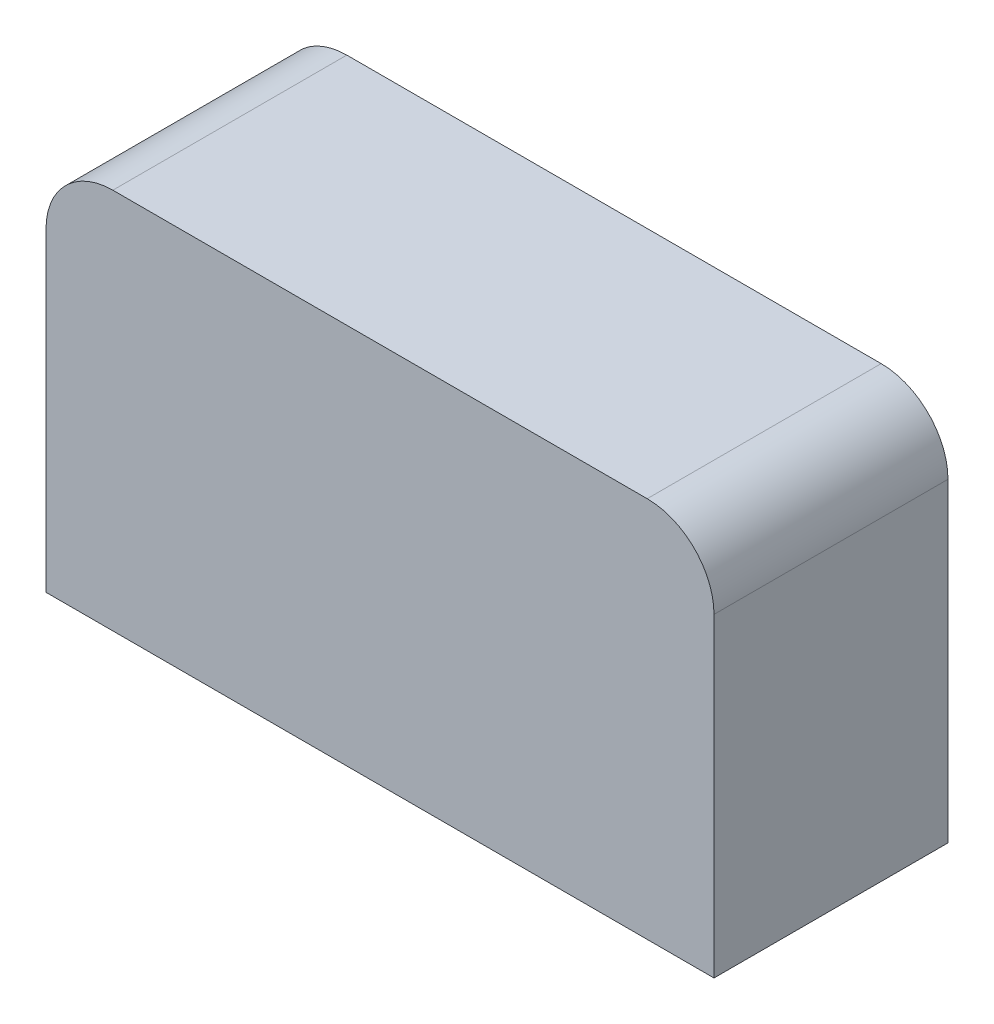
from build123d import *

# Parameters (mm, degrees)
SKETCH1_W           = 70
SKETCH1_H           = 40
BOSS_EXTRUDE1_DEPTH = 24.52
FILLET1_R           = 7
FILLET2_R           = 7
SKETCH4_W           = 36
SKETCH4_H           = 36
CUT_EXTRUDE1_DEPTH  = 20.45
SKETCH7_R           = 3.15
CUT_EXTRUDE2_DEPTH  = 8
CUT_EXTRUDE6_DEPTH  = 3
SKETCH16_R          = 3
CUT_EXTRUDE7_DEPTH  = 1


with BuildPart() as part:
    # Sketch1 → Boss-Extrude1 (new body)
    with BuildSketch(Plane.XY):
        with Locations((35, 20)):
            Rectangle(SKETCH1_W, SKETCH1_H)
    extrude(amount=BOSS_EXTRUDE1_DEPTH)

    # Fillet1
    fillet1_edges = [part.edges().sort_by_distance(p)[0] for p in [
        (0, 40, 12.26),
    ]]
    fillet(fillet1_edges, radius=FILLET1_R)

    # Fillet2
    fillet2_edges = [part.edges().sort_by_distance(p)[0] for p in [
        (70, 40, 12.26),
    ]]
    fillet(fillet2_edges, radius=FILLET2_R)

    # Sketch4 → Cut-Extrude1 (cut)
    with BuildSketch(Plane(origin=(0, 0, 0), x_dir=(-1, 0, 0), z_dir=(0, 0, -1))):
        with Locations((-35, 18)):
            Rectangle(SKETCH4_W, SKETCH4_H)
    extrude(amount=-CUT_EXTRUDE1_DEPTH, mode=Mode.SUBTRACT)

    # Sketch7 → Cut-Extrude2 (cut)
    with BuildSketch(Plane(origin=(0, 0, 0), x_dir=(-1, 0, 0), z_dir=(0, 0, -1))):
        with Locations((-65.185, 18)):
            Circle(SKETCH7_R)
        with Locations((-4.815, 18)):
            Circle(SKETCH7_R)
    extrude(amount=-CUT_EXTRUDE2_DEPTH, mode=Mode.SUBTRACT)

    # Sketch15 → Cut-Extrude6 (cut)
    with BuildSketch(Plane(origin=(0, 0, 0), x_dir=(-1, 0, 0), z_dir=(0, 0, -1))):
        with BuildLine():
            Line((-60.650183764, 18.749837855), (-53, 25.5))
            Line((-53, 25.5), (-53, 10.5))
            Line((-53, 10.5), (-60.650183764, 17.250162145))
            ThreePointArc((-60.650183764, 17.250162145), (-60.988562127, 18), (-60.650183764, 18.749837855))
        make_face()
        with BuildLine():
            Line((-17, 25.5), (-9.349816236, 18.749837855))
            ThreePointArc((-9.349816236, 18.749837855), (-9.011437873, 18), (-9.349816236, 17.250162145))
            Line((-9.349816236, 17.250162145), (-17, 10.5))
            Line((-17, 10.5), (-17, 25.5))
        make_face()
    extrude(amount=-CUT_EXTRUDE6_DEPTH, mode=Mode.SUBTRACT)

    # Sketch16 → Cut-Extrude7 (cut)
    with BuildSketch(Plane(origin=(0, 0, 20.45), x_dir=(-1, 0, 0), z_dir=(0, 0, -1))):
        with Locations((-35, 18)):
            Circle(SKETCH16_R)
    extrude(amount=-CUT_EXTRUDE7_DEPTH, mode=Mode.SUBTRACT)


solid = part.part
